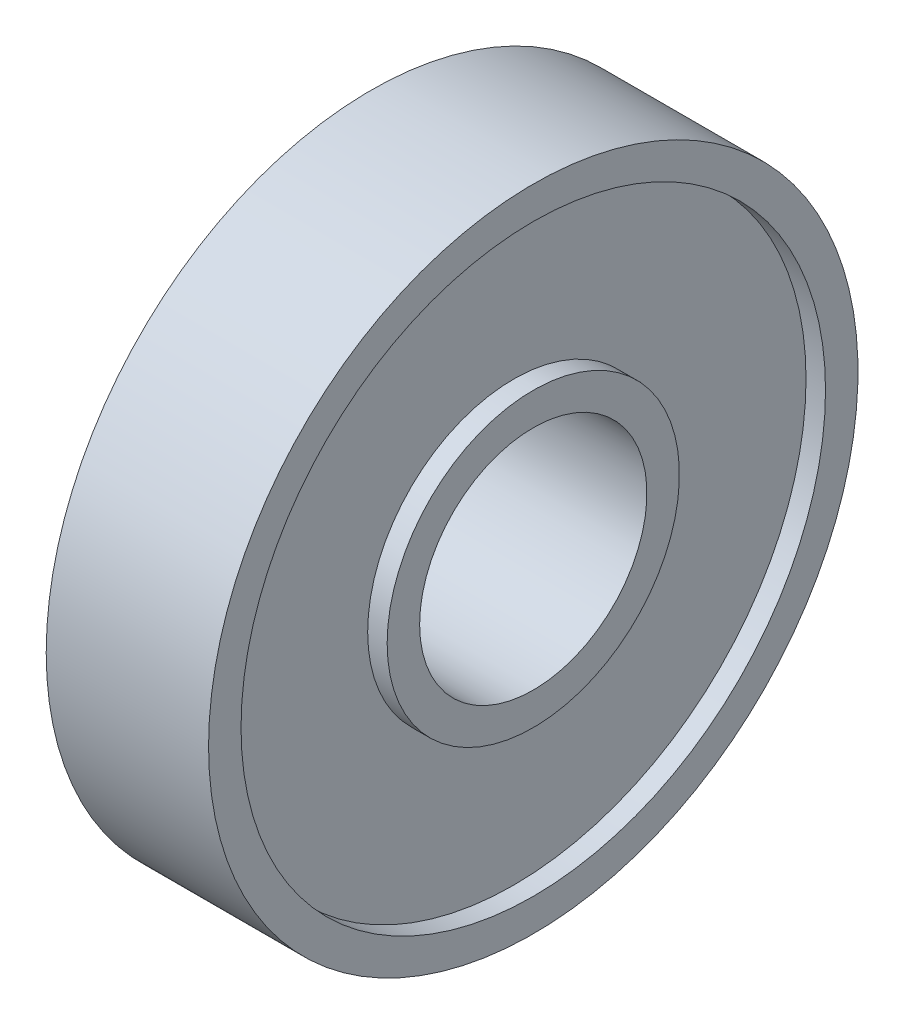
from build123d import *


with BuildPart() as part:
    # Esquisse1 → Base-R_volution (revolve)
    with BuildSketch(Plane.XY, mode=Mode.PRIVATE) as base_r_volution_sk:
        Polygon((0, 50), (0, 45), (3, 45), (3, 22.5), (0, 22.5), (0, 17.5), (25, 17.5), (25, 22.5), (22, 22.5), (22, 45), (25, 45), (25, 50), align=None)
    revolve(base_r_volution_sk.sketch.rotate(Axis((-3.79526862, 0, 0), (1, 0, 0)), 90), axis=Axis((-3.79526862, 0, 0), (1, 0, 0)))


solid = part.part
